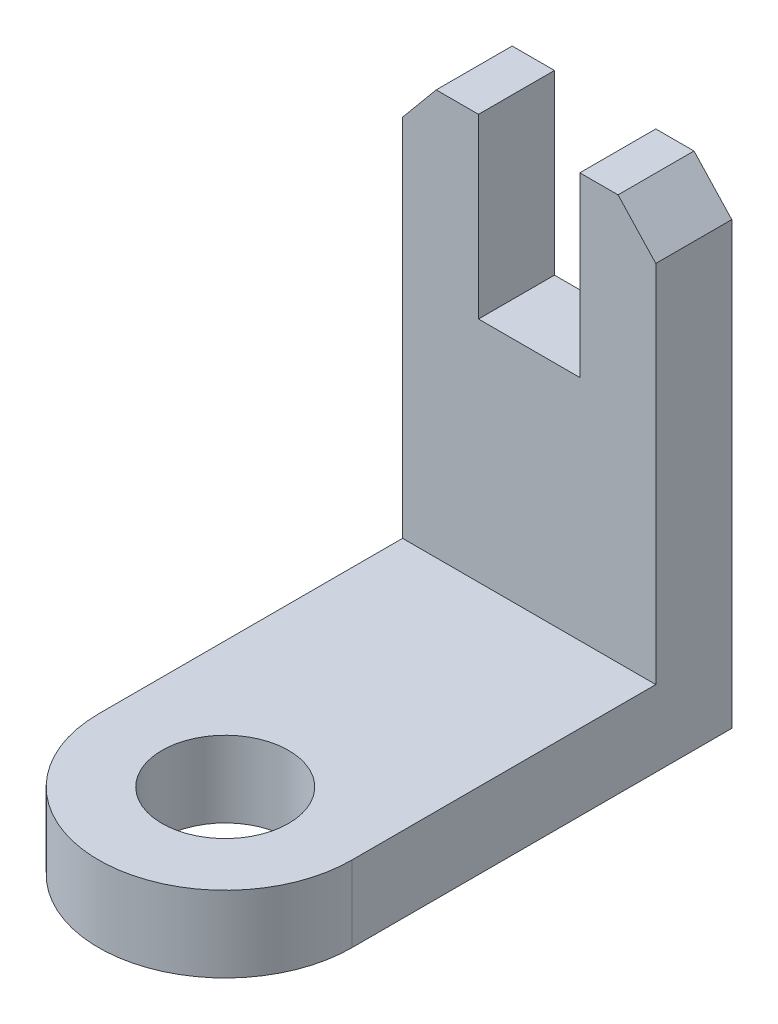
ISO-10303-21;
HEADER;
FILE_DESCRIPTION(('STEP AP214'),'2;1');
FILE_NAME('part.step','',(''),(''),'','','');
FILE_SCHEMA(('AUTOMOTIVE_DESIGN { 1 0 10303 214 1 1 1 1 }'));
ENDSEC;
DATA;
#1=APPLICATION_CONTEXT('core data for automotive mechanical design processes');
#2=APPLICATION_PROTOCOL_DEFINITION('international standard','automotive_design',2000,#1);
#3=PRODUCT_CONTEXT('',#1,'mechanical');
#4=PRODUCT('Part','Part','',(#3));
#5=PRODUCT_RELATED_PRODUCT_CATEGORY('part','',(#4));
#6=PRODUCT_DEFINITION_FORMATION('','',#4);
#7=PRODUCT_DEFINITION_CONTEXT('part definition',#1,'design');
#8=PRODUCT_DEFINITION('design','',#6,#7);
#9=PRODUCT_DEFINITION_SHAPE('','',#8);
#10=(LENGTH_UNIT() NAMED_UNIT(*) SI_UNIT(.MILLI.,.METRE.));
#11=(NAMED_UNIT(*) PLANE_ANGLE_UNIT() SI_UNIT($,.RADIAN.));
#12=(NAMED_UNIT(*) SI_UNIT($,.STERADIAN.) SOLID_ANGLE_UNIT());
#13=UNCERTAINTY_MEASURE_WITH_UNIT(LENGTH_MEASURE(1.E-05),#10,'distance_accuracy_value','');
#14=(GEOMETRIC_REPRESENTATION_CONTEXT(3) GLOBAL_UNCERTAINTY_ASSIGNED_CONTEXT((#13)) GLOBAL_UNIT_ASSIGNED_CONTEXT((#10,
#11,#12)) REPRESENTATION_CONTEXT('',''));
#15=CARTESIAN_POINT('',(0.,0.,0.));
#16=DIRECTION('',(0.,0.,1.));
#17=DIRECTION('',(1.,0.,0.));
#18=AXIS2_PLACEMENT_3D('',#15,#16,#17);
#19=CARTESIAN_POINT('',(-50.,80.,15.));
#20=DIRECTION('',(0.,-1.,0.));
#21=DIRECTION('',(0.,0.,-1.));
#22=AXIS2_PLACEMENT_3D('',#19,#20,#21);
#23=PLANE('',#22);
#24=DIRECTION('',(-1.,0.,0.));
#25=VECTOR('',#24,1.);
#26=CARTESIAN_POINT('',(-50.,80.,0.));
#27=LINE('',#26,#25);
#28=CARTESIAN_POINT('',(-35.,80.,0.));
#29=VERTEX_POINT('',#28);
#30=CARTESIAN_POINT('',(-43.3566884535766,80.,0.));
#31=VERTEX_POINT('',#30);
#32=EDGE_CURVE('E239',#29,#31,#27,.T.);
#33=ORIENTED_EDGE('',*,*,#32,.T.);
#34=DIRECTION('',(0.,0.,1.));
#35=VECTOR('',#34,1.);
#36=CARTESIAN_POINT('',(-43.3566884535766,80.,15.));
#37=LINE('',#36,#35);
#38=CARTESIAN_POINT('',(-43.3566884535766,80.,15.));
#39=VERTEX_POINT('',#38);
#40=EDGE_CURVE('E53',#31,#39,#37,.T.);
#41=ORIENTED_EDGE('',*,*,#40,.T.);
#42=DIRECTION('',(-1.,0.,0.));
#43=VECTOR('',#42,1.);
#44=CARTESIAN_POINT('',(-50.,80.,15.));
#45=LINE('',#44,#43);
#46=CARTESIAN_POINT('',(-35.,80.,15.));
#47=VERTEX_POINT('',#46);
#48=EDGE_CURVE('E138',#47,#39,#45,.T.);
#49=ORIENTED_EDGE('',*,*,#48,.F.);
#50=DIRECTION('',(0.,0.,-1.));
#51=VECTOR('',#50,1.);
#52=CARTESIAN_POINT('',(-35.,80.,15.));
#53=LINE('',#52,#51);
#54=EDGE_CURVE('E200',#47,#29,#53,.T.);
#55=ORIENTED_EDGE('',*,*,#54,.T.);
#56=EDGE_LOOP('',(#33,#41,#49,#55));
#57=FACE_BOUND('',#56,.T.);
#58=ADVANCED_FACE('F31',(#57),#23,.F.);
#59=CARTESIAN_POINT('',(-25.,-15.,75.));
#60=DIRECTION('',(0.,1.,0.));
#61=DIRECTION('',(-1.,0.,0.));
#62=AXIS2_PLACEMENT_3D('',#59,#60,#61);
#63=CYLINDRICAL_SURFACE('',#62,25.);
#64=DIRECTION('',(0.,1.,0.));
#65=VECTOR('',#64,1.);
#66=CARTESIAN_POINT('',(-50.,0.,75.));
#67=LINE('',#66,#65);
#68=CARTESIAN_POINT('',(-50.,-15.,75.));
#69=VERTEX_POINT('',#68);
#70=CARTESIAN_POINT('',(-50.,0.,75.));
#71=VERTEX_POINT('',#70);
#72=EDGE_CURVE('E166',#69,#71,#67,.T.);
#73=ORIENTED_EDGE('',*,*,#72,.F.);
#74=CARTESIAN_POINT('',(-25.,-15.,75.));
#75=DIRECTION('',(0.,-1.,0.));
#76=DIRECTION('',(1.,0.,0.));
#77=AXIS2_PLACEMENT_3D('',#74,#75,#76);
#78=CIRCLE('',#77,25.);
#79=CARTESIAN_POINT('',(0.,-15.,75.));
#80=VERTEX_POINT('',#79);
#81=EDGE_CURVE('E162',#80,#69,#78,.T.);
#82=ORIENTED_EDGE('',*,*,#81,.F.);
#83=DIRECTION('',(0.,1.,0.));
#84=VECTOR('',#83,1.);
#85=CARTESIAN_POINT('',(0.,80.,75.));
#86=LINE('',#85,#84);
#87=CARTESIAN_POINT('',(0.,0.,75.));
#88=VERTEX_POINT('',#87);
#89=EDGE_CURVE('E164',#88,#80,#86,.F.);
#90=ORIENTED_EDGE('',*,*,#89,.F.);
#91=CARTESIAN_POINT('',(-25.,0.,75.));
#92=DIRECTION('',(0.,-1.,0.));
#93=DIRECTION('',(1.,0.,0.));
#94=AXIS2_PLACEMENT_3D('',#91,#92,#93);
#95=CIRCLE('',#94,25.);
#96=EDGE_CURVE('E160',#71,#88,#95,.F.);
#97=ORIENTED_EDGE('',*,*,#96,.F.);
#98=EDGE_LOOP('',(#73,#82,#90,#97));
#99=FACE_BOUND('',#98,.T.);
#100=ADVANCED_FACE('F33',(#99),#63,.T.);
#101=CARTESIAN_POINT('',(0.,80.,15.));
#102=DIRECTION('',(-1.,0.,0.));
#103=DIRECTION('',(0.,-1.,0.));
#104=AXIS2_PLACEMENT_3D('',#101,#102,#103);
#105=PLANE('',#104);
#106=DIRECTION('',(0.,1.,0.));
#107=VECTOR('',#106,1.);
#108=CARTESIAN_POINT('',(0.,80.,0.));
#109=LINE('',#108,#107);
#110=CARTESIAN_POINT('',(0.,-15.,0.));
#111=VERTEX_POINT('',#110);
#112=CARTESIAN_POINT('',(0.,72.,0.));
#113=VERTEX_POINT('',#112);
#114=EDGE_CURVE('E132',#111,#113,#109,.T.);
#115=ORIENTED_EDGE('',*,*,#114,.T.);
#116=DIRECTION('',(0.,0.,1.));
#117=VECTOR('',#116,1.);
#118=CARTESIAN_POINT('',(0.,72.,0.));
#119=LINE('',#118,#117);
#120=CARTESIAN_POINT('',(0.,72.,15.));
#121=VERTEX_POINT('',#120);
#122=EDGE_CURVE('E46',#113,#121,#119,.T.);
#123=ORIENTED_EDGE('',*,*,#122,.T.);
#124=DIRECTION('',(0.,1.,0.));
#125=VECTOR('',#124,1.);
#126=CARTESIAN_POINT('',(0.,80.,15.));
#127=LINE('',#126,#125);
#128=CARTESIAN_POINT('',(0.,0.,15.));
#129=VERTEX_POINT('',#128);
#130=EDGE_CURVE('E130',#129,#121,#127,.T.);
#131=ORIENTED_EDGE('',*,*,#130,.F.);
#132=DIRECTION('',(0.,0.,1.));
#133=VECTOR('',#132,1.);
#134=CARTESIAN_POINT('',(0.,0.,0.));
#135=LINE('',#134,#133);
#136=EDGE_CURVE('E183',#129,#88,#135,.T.);
#137=ORIENTED_EDGE('',*,*,#136,.T.);
#138=ORIENTED_EDGE('',*,*,#89,.T.);
#139=DIRECTION('',(0.,0.,1.));
#140=VECTOR('',#139,1.);
#141=CARTESIAN_POINT('',(0.,-15.,0.));
#142=LINE('',#141,#140);
#143=EDGE_CURVE('E185',#111,#80,#142,.T.);
#144=ORIENTED_EDGE('',*,*,#143,.F.);
#145=EDGE_LOOP('',(#115,#123,#131,#137,#138,#144));
#146=FACE_BOUND('',#145,.T.);
#147=ADVANCED_FACE('F128',(#146),#105,.F.);
#148=CARTESIAN_POINT('',(-7.45608905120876,80.,15.));
#149=VERTEX_POINT('',#148);
#150=CARTESIAN_POINT('',(-15.,80.,15.));
#151=VERTEX_POINT('',#150);
#152=EDGE_CURVE('E142',#149,#151,#45,.T.);
#153=ORIENTED_EDGE('',*,*,#152,.F.);
#154=DIRECTION('',(0.,0.,-1.));
#155=VECTOR('',#154,1.);
#156=CARTESIAN_POINT('',(-7.45608905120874,80.,15.));
#157=LINE('',#156,#155);
#158=CARTESIAN_POINT('',(-7.45608905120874,80.,0.));
#159=VERTEX_POINT('',#158);
#160=EDGE_CURVE('E120',#149,#159,#157,.T.);
#161=ORIENTED_EDGE('',*,*,#160,.T.);
#162=CARTESIAN_POINT('',(-15.,80.,0.));
#163=VERTEX_POINT('',#162);
#164=EDGE_CURVE('E144',#159,#163,#27,.T.);
#165=ORIENTED_EDGE('',*,*,#164,.T.);
#166=DIRECTION('',(0.,0.,1.));
#167=VECTOR('',#166,1.);
#168=CARTESIAN_POINT('',(-15.,80.,15.));
#169=LINE('',#168,#167);
#170=EDGE_CURVE('E204',#163,#151,#169,.T.);
#171=ORIENTED_EDGE('',*,*,#170,.T.);
#172=EDGE_LOOP('',(#153,#161,#165,#171));
#173=FACE_BOUND('',#172,.T.);
#174=ADVANCED_FACE('F235',(#173),#23,.F.);
#175=CARTESIAN_POINT('',(-50.,0.,15.));
#176=DIRECTION('',(1.,0.,0.));
#177=DIRECTION('',(0.,0.,-1.));
#178=AXIS2_PLACEMENT_3D('',#175,#176,#177);
#179=PLANE('',#178);
#180=DIRECTION('',(0.,-1.,0.));
#181=VECTOR('',#180,1.);
#182=CARTESIAN_POINT('',(-50.,0.,15.));
#183=LINE('',#182,#181);
#184=CARTESIAN_POINT('',(-50.,72.,15.));
#185=VERTEX_POINT('',#184);
#186=CARTESIAN_POINT('',(-50.,0.,15.));
#187=VERTEX_POINT('',#186);
#188=EDGE_CURVE('E156',#185,#187,#183,.T.);
#189=ORIENTED_EDGE('',*,*,#188,.F.);
#190=DIRECTION('',(0.,0.,1.));
#191=VECTOR('',#190,1.);
#192=CARTESIAN_POINT('',(-50.,72.,0.));
#193=LINE('',#192,#191);
#194=CARTESIAN_POINT('',(-50.,72.,0.));
#195=VERTEX_POINT('',#194);
#196=EDGE_CURVE('E227',#195,#185,#193,.T.);
#197=ORIENTED_EDGE('',*,*,#196,.F.);
#198=DIRECTION('',(0.,-1.,0.));
#199=VECTOR('',#198,1.);
#200=CARTESIAN_POINT('',(-50.,0.,0.));
#201=LINE('',#200,#199);
#202=CARTESIAN_POINT('',(-50.,-15.,0.));
#203=VERTEX_POINT('',#202);
#204=EDGE_CURVE('E139',#195,#203,#201,.T.);
#205=ORIENTED_EDGE('',*,*,#204,.T.);
#206=DIRECTION('',(0.,0.,-1.));
#207=VECTOR('',#206,1.);
#208=CARTESIAN_POINT('',(-50.,-15.,100.));
#209=LINE('',#208,#207);
#210=EDGE_CURVE('E176',#69,#203,#209,.T.);
#211=ORIENTED_EDGE('',*,*,#210,.F.);
#212=ORIENTED_EDGE('',*,*,#72,.T.);
#213=DIRECTION('',(0.,0.,-1.));
#214=VECTOR('',#213,1.);
#215=CARTESIAN_POINT('',(-50.,0.,100.));
#216=LINE('',#215,#214);
#217=EDGE_CURVE('E153',#71,#187,#216,.T.);
#218=ORIENTED_EDGE('',*,*,#217,.T.);
#219=EDGE_LOOP('',(#189,#197,#205,#211,#212,#218));
#220=FACE_BOUND('',#219,.T.);
#221=ADVANCED_FACE('F174',(#220),#179,.F.);
#222=CARTESIAN_POINT('',(0.,80.,15.));
#223=DIRECTION('',(0.,0.,1.));
#224=DIRECTION('',(1.,0.,0.));
#225=AXIS2_PLACEMENT_3D('',#222,#223,#224);
#226=PLANE('',#225);
#227=DIRECTION('',(0.681801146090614,-0.731537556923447,0.));
#228=VECTOR('',#227,1.);
#229=CARTESIAN_POINT('',(0.,72.,15.));
#230=LINE('',#229,#228);
#231=EDGE_CURVE('E117',#149,#121,#230,.T.);
#232=ORIENTED_EDGE('',*,*,#231,.F.);
#233=ORIENTED_EDGE('',*,*,#152,.T.);
#234=DIRECTION('',(0.,1.,0.));
#235=VECTOR('',#234,1.);
#236=CARTESIAN_POINT('',(-15.,85.3127853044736,15.));
#237=LINE('',#236,#235);
#238=CARTESIAN_POINT('',(-15.,45.,15.));
#239=VERTEX_POINT('',#238);
#240=EDGE_CURVE('E213',#239,#151,#237,.T.);
#241=ORIENTED_EDGE('',*,*,#240,.F.);
#242=DIRECTION('',(1.,0.,0.));
#243=VECTOR('',#242,1.);
#244=CARTESIAN_POINT('',(-35.,45.,15.));
#245=LINE('',#244,#243);
#246=CARTESIAN_POINT('',(-35.,45.,15.));
#247=VERTEX_POINT('',#246);
#248=EDGE_CURVE('E217',#247,#239,#245,.T.);
#249=ORIENTED_EDGE('',*,*,#248,.F.);
#250=DIRECTION('',(0.,-1.,0.));
#251=VECTOR('',#250,1.);
#252=CARTESIAN_POINT('',(-35.,85.3127853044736,15.));
#253=LINE('',#252,#251);
#254=EDGE_CURVE('E220',#47,#247,#253,.T.);
#255=ORIENTED_EDGE('',*,*,#254,.F.);
#256=ORIENTED_EDGE('',*,*,#48,.T.);
#257=DIRECTION('',(0.638857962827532,0.76932470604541,0.));
#258=VECTOR('',#257,1.);
#259=CARTESIAN_POINT('',(-50.,72.,15.));
#260=LINE('',#259,#258);
#261=EDGE_CURVE('E230',#185,#39,#260,.T.);
#262=ORIENTED_EDGE('',*,*,#261,.F.);
#263=ORIENTED_EDGE('',*,*,#188,.T.);
#264=DIRECTION('',(1.,0.,0.));
#265=VECTOR('',#264,1.);
#266=CARTESIAN_POINT('',(0.,0.,15.));
#267=LINE('',#266,#265);
#268=EDGE_CURVE('E137',#187,#129,#267,.T.);
#269=ORIENTED_EDGE('',*,*,#268,.T.);
#270=ORIENTED_EDGE('',*,*,#130,.T.);
#271=EDGE_LOOP('',(#232,#233,#241,#249,#255,#256,#262,#263,#269,#270));
#272=FACE_BOUND('',#271,.T.);
#273=ADVANCED_FACE('F135',(#272),#226,.T.);
#274=CARTESIAN_POINT('',(0.,80.,0.));
#275=DIRECTION('',(0.,0.,1.));
#276=DIRECTION('',(1.,0.,0.));
#277=AXIS2_PLACEMENT_3D('',#274,#275,#276);
#278=PLANE('',#277);
#279=ORIENTED_EDGE('',*,*,#164,.F.);
#280=DIRECTION('',(0.681801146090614,-0.731537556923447,0.));
#281=VECTOR('',#280,1.);
#282=CARTESIAN_POINT('',(-3.99010515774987,76.2811775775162,0.));
#283=LINE('',#282,#281);
#284=EDGE_CURVE('E11',#159,#113,#283,.T.);
#285=ORIENTED_EDGE('',*,*,#284,.T.);
#286=ORIENTED_EDGE('',*,*,#114,.F.);
#287=DIRECTION('',(1.,0.,0.));
#288=VECTOR('',#287,1.);
#289=CARTESIAN_POINT('',(-50.,-15.,0.));
#290=LINE('',#289,#288);
#291=EDGE_CURVE('E182',#203,#111,#290,.T.);
#292=ORIENTED_EDGE('',*,*,#291,.F.);
#293=ORIENTED_EDGE('',*,*,#204,.F.);
#294=DIRECTION('',(0.638857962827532,0.76932470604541,0.));
#295=VECTOR('',#294,1.);
#296=CARTESIAN_POINT('',(-50.,72.,0.));
#297=LINE('',#296,#295);
#298=EDGE_CURVE('E229',#195,#31,#297,.T.);
#299=ORIENTED_EDGE('',*,*,#298,.T.);
#300=ORIENTED_EDGE('',*,*,#32,.F.);
#301=DIRECTION('',(0.,-1.,0.));
#302=VECTOR('',#301,1.);
#303=CARTESIAN_POINT('',(-35.,80.,0.));
#304=LINE('',#303,#302);
#305=CARTESIAN_POINT('',(-35.,45.,0.));
#306=VERTEX_POINT('',#305);
#307=EDGE_CURVE('E39',#29,#306,#304,.T.);
#308=ORIENTED_EDGE('',*,*,#307,.T.);
#309=DIRECTION('',(1.,0.,0.));
#310=VECTOR('',#309,1.);
#311=CARTESIAN_POINT('',(-35.,45.,0.));
#312=LINE('',#311,#310);
#313=CARTESIAN_POINT('',(-15.,45.,0.));
#314=VERTEX_POINT('',#313);
#315=EDGE_CURVE('E216',#306,#314,#312,.T.);
#316=ORIENTED_EDGE('',*,*,#315,.T.);
#317=DIRECTION('',(0.,1.,0.));
#318=VECTOR('',#317,1.);
#319=CARTESIAN_POINT('',(-15.,85.3127853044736,0.));
#320=LINE('',#319,#318);
#321=EDGE_CURVE('E211',#314,#163,#320,.T.);
#322=ORIENTED_EDGE('',*,*,#321,.T.);
#323=EDGE_LOOP('',(#279,#285,#286,#292,#293,#299,#300,#308,#316,#322));
#324=FACE_BOUND('',#323,.T.);
#325=ADVANCED_FACE('F238',(#324),#278,.F.);
#326=CARTESIAN_POINT('',(0.,-15.,0.));
#327=DIRECTION('',(0.,-1.,0.));
#328=DIRECTION('',(1.,0.,0.));
#329=AXIS2_PLACEMENT_3D('',#326,#327,#328);
#330=PLANE('',#329);
#331=ORIENTED_EDGE('',*,*,#143,.T.);
#332=ORIENTED_EDGE('',*,*,#81,.T.);
#333=ORIENTED_EDGE('',*,*,#210,.T.);
#334=ORIENTED_EDGE('',*,*,#291,.T.);
#335=EDGE_LOOP('',(#331,#332,#333,#334));
#336=FACE_BOUND('',#335,.T.);
#337=CARTESIAN_POINT('',(-25.,-15.,75.));
#338=DIRECTION('',(0.,-1.,0.));
#339=DIRECTION('',(1.,0.,0.));
#340=AXIS2_PLACEMENT_3D('',#337,#338,#339);
#341=CIRCLE('',#340,12.5);
#342=CARTESIAN_POINT('',(-12.5,-15.,75.));
#343=VERTEX_POINT('',#342);
#344=EDGE_CURVE('E187',#343,#343,#341,.T.);
#345=ORIENTED_EDGE('',*,*,#344,.F.);
#346=EDGE_LOOP('',(#345));
#347=FACE_BOUND('',#346,.T.);
#348=ADVANCED_FACE('F300',(#336,#347),#330,.T.);
#349=CARTESIAN_POINT('',(0.,0.,0.));
#350=DIRECTION('',(0.,-1.,0.));
#351=DIRECTION('',(1.,0.,0.));
#352=AXIS2_PLACEMENT_3D('',#349,#350,#351);
#353=PLANE('',#352);
#354=ORIENTED_EDGE('',*,*,#217,.F.);
#355=ORIENTED_EDGE('',*,*,#96,.T.);
#356=ORIENTED_EDGE('',*,*,#136,.F.);
#357=ORIENTED_EDGE('',*,*,#268,.F.);
#358=EDGE_LOOP('',(#354,#355,#356,#357));
#359=FACE_BOUND('',#358,.T.);
#360=CARTESIAN_POINT('',(-25.,0.,75.));
#361=DIRECTION('',(0.,-1.,0.));
#362=DIRECTION('',(1.,0.,0.));
#363=AXIS2_PLACEMENT_3D('',#360,#361,#362);
#364=CIRCLE('',#363,12.5);
#365=CARTESIAN_POINT('',(-12.5,0.,75.));
#366=VERTEX_POINT('',#365);
#367=EDGE_CURVE('E190',#366,#366,#364,.T.);
#368=ORIENTED_EDGE('',*,*,#367,.T.);
#369=EDGE_LOOP('',(#368));
#370=FACE_BOUND('',#369,.T.);
#371=ADVANCED_FACE('F179',(#359,#370),#353,.F.);
#372=CARTESIAN_POINT('',(-25.,-15.,75.));
#373=DIRECTION('',(0.,1.,0.));
#374=DIRECTION('',(-1.,0.,0.));
#375=AXIS2_PLACEMENT_3D('',#372,#373,#374);
#376=CYLINDRICAL_SURFACE('',#375,12.5);
#377=ORIENTED_EDGE('',*,*,#344,.T.);
#378=EDGE_LOOP('',(#377));
#379=FACE_BOUND('',#378,.T.);
#380=ORIENTED_EDGE('',*,*,#367,.F.);
#381=EDGE_LOOP('',(#380));
#382=FACE_BOUND('',#381,.T.);
#383=ADVANCED_FACE('F270',(#379,#382),#376,.F.);
#384=CARTESIAN_POINT('',(-35.,85.3127853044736,0.));
#385=DIRECTION('',(-1.,0.,0.));
#386=DIRECTION('',(0.,-1.,0.));
#387=AXIS2_PLACEMENT_3D('',#384,#385,#386);
#388=PLANE('',#387);
#389=ORIENTED_EDGE('',*,*,#254,.T.);
#390=DIRECTION('',(0.,0.,1.));
#391=VECTOR('',#390,1.);
#392=CARTESIAN_POINT('',(-35.,45.,0.));
#393=LINE('',#392,#391);
#394=EDGE_CURVE('E208',#306,#247,#393,.T.);
#395=ORIENTED_EDGE('',*,*,#394,.F.);
#396=ORIENTED_EDGE('',*,*,#307,.F.);
#397=ORIENTED_EDGE('',*,*,#54,.F.);
#398=EDGE_LOOP('',(#389,#395,#396,#397));
#399=FACE_BOUND('',#398,.T.);
#400=ADVANCED_FACE('F256',(#399),#388,.F.);
#401=CARTESIAN_POINT('',(-15.,85.3127853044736,0.));
#402=DIRECTION('',(1.,0.,0.));
#403=DIRECTION('',(0.,1.,0.));
#404=AXIS2_PLACEMENT_3D('',#401,#402,#403);
#405=PLANE('',#404);
#406=ORIENTED_EDGE('',*,*,#321,.F.);
#407=DIRECTION('',(0.,0.,1.));
#408=VECTOR('',#407,1.);
#409=CARTESIAN_POINT('',(-15.,45.,0.));
#410=LINE('',#409,#408);
#411=EDGE_CURVE('E207',#314,#239,#410,.T.);
#412=ORIENTED_EDGE('',*,*,#411,.T.);
#413=ORIENTED_EDGE('',*,*,#240,.T.);
#414=ORIENTED_EDGE('',*,*,#170,.F.);
#415=EDGE_LOOP('',(#406,#412,#413,#414));
#416=FACE_BOUND('',#415,.T.);
#417=ADVANCED_FACE('F262',(#416),#405,.F.);
#418=CARTESIAN_POINT('',(-35.,45.,0.));
#419=DIRECTION('',(0.,-1.,0.));
#420=DIRECTION('',(0.,0.,-1.));
#421=AXIS2_PLACEMENT_3D('',#418,#419,#420);
#422=PLANE('',#421);
#423=ORIENTED_EDGE('',*,*,#248,.T.);
#424=ORIENTED_EDGE('',*,*,#411,.F.);
#425=ORIENTED_EDGE('',*,*,#315,.F.);
#426=ORIENTED_EDGE('',*,*,#394,.T.);
#427=EDGE_LOOP('',(#423,#424,#425,#426));
#428=FACE_BOUND('',#427,.T.);
#429=ADVANCED_FACE('F259',(#428),#422,.F.);
#430=CARTESIAN_POINT('',(-50.,72.,0.));
#431=DIRECTION('',(0.76932470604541,-0.638857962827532,0.));
#432=DIRECTION('',(0.638857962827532,0.76932470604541,0.));
#433=AXIS2_PLACEMENT_3D('',#430,#431,#432);
#434=PLANE('',#433);
#435=ORIENTED_EDGE('',*,*,#298,.F.);
#436=ORIENTED_EDGE('',*,*,#196,.T.);
#437=ORIENTED_EDGE('',*,*,#261,.T.);
#438=ORIENTED_EDGE('',*,*,#40,.F.);
#439=EDGE_LOOP('',(#435,#436,#437,#438));
#440=FACE_BOUND('',#439,.T.);
#441=ADVANCED_FACE('F250',(#440),#434,.F.);
#442=CARTESIAN_POINT('',(0.,72.,0.));
#443=DIRECTION('',(-0.731537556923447,-0.681801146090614,0.));
#444=DIRECTION('',(0.681801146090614,-0.731537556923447,0.));
#445=AXIS2_PLACEMENT_3D('',#442,#443,#444);
#446=PLANE('',#445);
#447=ORIENTED_EDGE('',*,*,#231,.T.);
#448=ORIENTED_EDGE('',*,*,#122,.F.);
#449=ORIENTED_EDGE('',*,*,#284,.F.);
#450=ORIENTED_EDGE('',*,*,#160,.F.);
#451=EDGE_LOOP('',(#447,#448,#449,#450));
#452=FACE_BOUND('',#451,.T.);
#453=ADVANCED_FACE('F118',(#452),#446,.F.);
#454=CLOSED_SHELL('',(#58,#100,#147,#174,#221,#273,#325,#348,#371,#383,#400,#417,#429,#441,#453));
#455=MANIFOLD_SOLID_BREP('B2',#454);
#456=ADVANCED_BREP_SHAPE_REPRESENTATION('',(#18,#455),#14);
#457=SHAPE_DEFINITION_REPRESENTATION(#9,#456);
ENDSEC;
END-ISO-10303-21;
